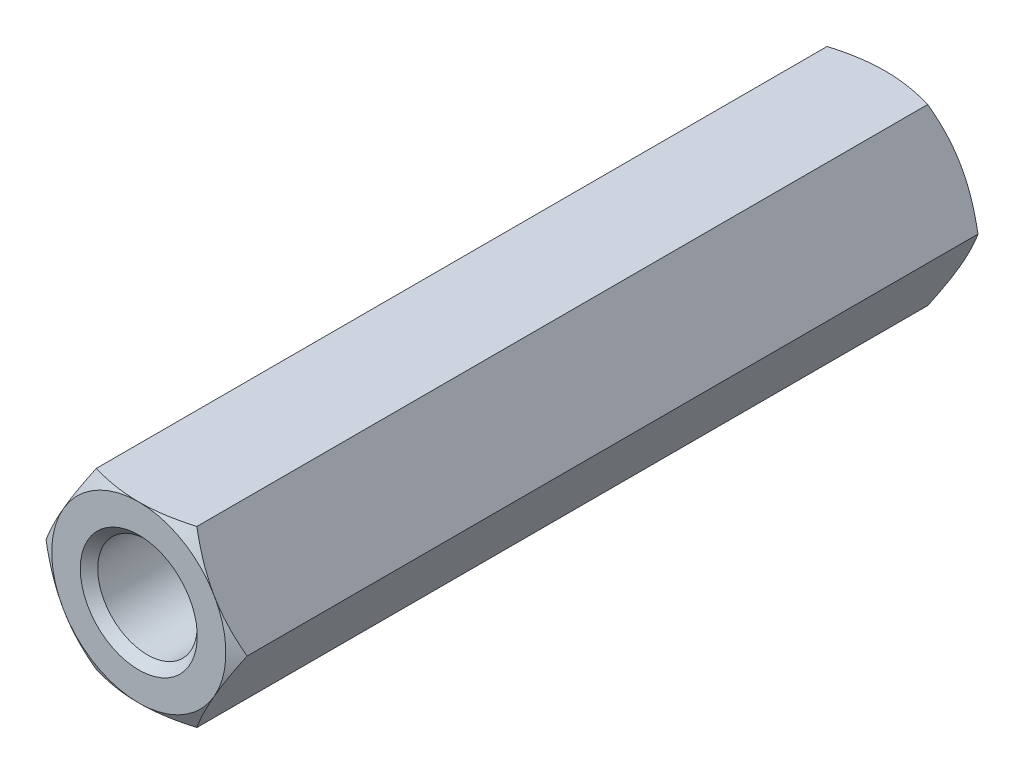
from build123d import *

# Parameters (mm, degrees)
BOSS_EXTRUDE1_DEPTH      = 15
SKETCH2_OUTSIDE_W        = 72.394
SKETCH2_OUTSIDE_H        = 71.312
SKETCH2_OUTSIDE_R        = 3.5
CUT_EXTRUDE1_DEPTH       = 16.924300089
CUT_EXTRUDE1_DRAFT       = -60
SKETCH3_R                = 2
SKETCH3_R_2              = 1.65
CUT_EXTRUDE2_DEPTH       = 10
SKETCH3_2_R              = 1.65
CUT_EXTRUDE3_DEPTH       = 11.05
CHAMFER1_SIZE            = 0.35
MIRROR1_COPY_1_SKETCH_W  = 72.394
MIRROR1_COPY_1_SKETCH_H  = 71.312
MIRROR1_COPY_1_SKETCH_R  = 3.5
MIRROR1_COPY_1_DEPTH     = 16.924300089
MIRROR1_COPY_1_DRAFT     = -60
CHAMFER1_OF_MIRROR1_SIZE = 0.35


with BuildPart() as part:
    # Sketch1 → Boss-Extrude1 (new body)
    with BuildSketch(Plane.XY):
        Polygon((2.020725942, 3.5), (-2.020725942, 3.5), (-4.041451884, 0), (-2.020725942, -3.5), (2.020725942, -3.5), (4.041451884, 0), align=None)
    boss_extrude1 = extrude(amount=-BOSS_EXTRUDE1_DEPTH)


with BuildPart() as cut_extrude1_tool:
    # Sketch2 outside → Cut-Extrude1 (with draft: the straight prism first)
    with BuildSketch(Plane(origin=(0, 0, -15), x_dir=(-1, 0, 0), z_dir=(0, 0, -1))):
        Rectangle(SKETCH2_OUTSIDE_W, SKETCH2_OUTSIDE_H)
        Circle(SKETCH2_OUTSIDE_R, mode=Mode.SUBTRACT)
    extrude(amount=-CUT_EXTRUDE1_DEPTH)
    # Cut-Extrude1: the draft: its side faces are tilted about the plane it starts from
    cut_extrude1_sides = [cut_extrude1_tool.faces().sort_by_distance(p)[0] for p in [
        (0, -35.656, -6.537849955),
        (-36.197, 0, -6.537849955),
        (0, 35.656, -6.537849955),
        (36.197, 0, -6.537849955),
        (3.5, 0, -6.537849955),
    ]]
    draft(cut_extrude1_sides, Plane(origin=(0, 0, -15), x_dir=(-1, 0, 0), z_dir=(0, 0, -1)), CUT_EXTRUDE1_DRAFT)


with BuildPart() as part_1:
    add(part.part)

    # Cut-Extrude1: cut by cut_extrude1_tool
    add(cut_extrude1_tool.part, mode=Mode.SUBTRACT)

    # Sketch3 → Cut-Extrude2 (cut)
    with BuildSketch(Plane(origin=(0, 0, -15), x_dir=(-1, 0, 0), z_dir=(0, 0, -1))):
        Circle(SKETCH3_R)
        Circle(SKETCH3_R_2, mode=Mode.SUBTRACT)
    cut_extrude2 = extrude(amount=-CUT_EXTRUDE2_DEPTH, mode=Mode.SUBTRACT)

    # Sketch3_2 → Cut-Extrude3 (cut)
    with BuildSketch(Plane(origin=(0, 0, -15), x_dir=(-1, 0, 0), z_dir=(0, 0, -1))):
        Circle(SKETCH3_2_R)
    cut_extrude3 = extrude(amount=-CUT_EXTRUDE3_DEPTH, mode=Mode.SUBTRACT)

    # Cut-Extrude4 cone 1 section (on through the dimple's axis) → Cut-Extrude4 (revolve, cut)
    with BuildSketch(Plane(origin=(0, 0, -3.95), x_dir=(0, 1, 0), z_dir=(1, 0, 0))):
        Polygon((0, 0), (1.65, 0), (0, 0.952627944), align=None)
    revolve(axis=Axis((0, 0, -3.95), (0, 0, 1)), mode=Mode.SUBTRACT)

    # Chamfer1
    chamfer1_edges = [part_1.edges().sort_by_distance(p)[0] for p in [
        (2, 0, -15),
    ]]
    chamfer(chamfer1_edges, length=CHAMFER1_SIZE)

    # Mirror1: Boss-Extrude1, Cut-Extrude2, Cut-Extrude3 across plane
    add(boss_extrude1.mirror(Plane.XY))
    add(cut_extrude2.mirror(Plane.XY), mode=Mode.SUBTRACT)
    add(cut_extrude3.mirror(Plane.XY), mode=Mode.SUBTRACT)


with BuildPart() as mirror1_copy_1_tool:
    # Mirror1 copy 1 sketch → Mirror1 copy 1 (with draft: the straight prism first)
    with BuildSketch(Plane(origin=(0, 0, 15), x_dir=(-1, 0, 0), z_dir=(0, 0, 1))):
        Rectangle(MIRROR1_COPY_1_SKETCH_W, MIRROR1_COPY_1_SKETCH_H)
        Circle(MIRROR1_COPY_1_SKETCH_R, mode=Mode.SUBTRACT)
    extrude(amount=-MIRROR1_COPY_1_DEPTH)
    # Mirror1 copy 1: the draft: its side faces are tilted about the plane it starts from
    mirror1_copy_1_sides = [mirror1_copy_1_tool.faces().sort_by_distance(p)[0] for p in [
        (0, -35.656, 6.537849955),
        (-36.197, 0, 6.537849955),
        (0, 35.656, 6.537849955),
        (36.197, 0, 6.537849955),
        (3.5, 0, 6.537849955),
    ]]
    draft(mirror1_copy_1_sides, Plane(origin=(0, 0, 15), x_dir=(-1, 0, 0), z_dir=(0, 0, 1)), MIRROR1_COPY_1_DRAFT)


with BuildPart() as part_2:
    add(part_1.part)

    # Mirror1 copy 1: cut by mirror1_copy_1_tool
    add(mirror1_copy_1_tool.part, mode=Mode.SUBTRACT)

    # Chamfer1 of Mirror1
    chamfer1_of_mirror1_edges = [part_2.edges().sort_by_distance(p)[0] for p in [
        (2, 0, 15),
    ]]
    chamfer(chamfer1_of_mirror1_edges, length=CHAMFER1_OF_MIRROR1_SIZE)


solid = part_2.part
